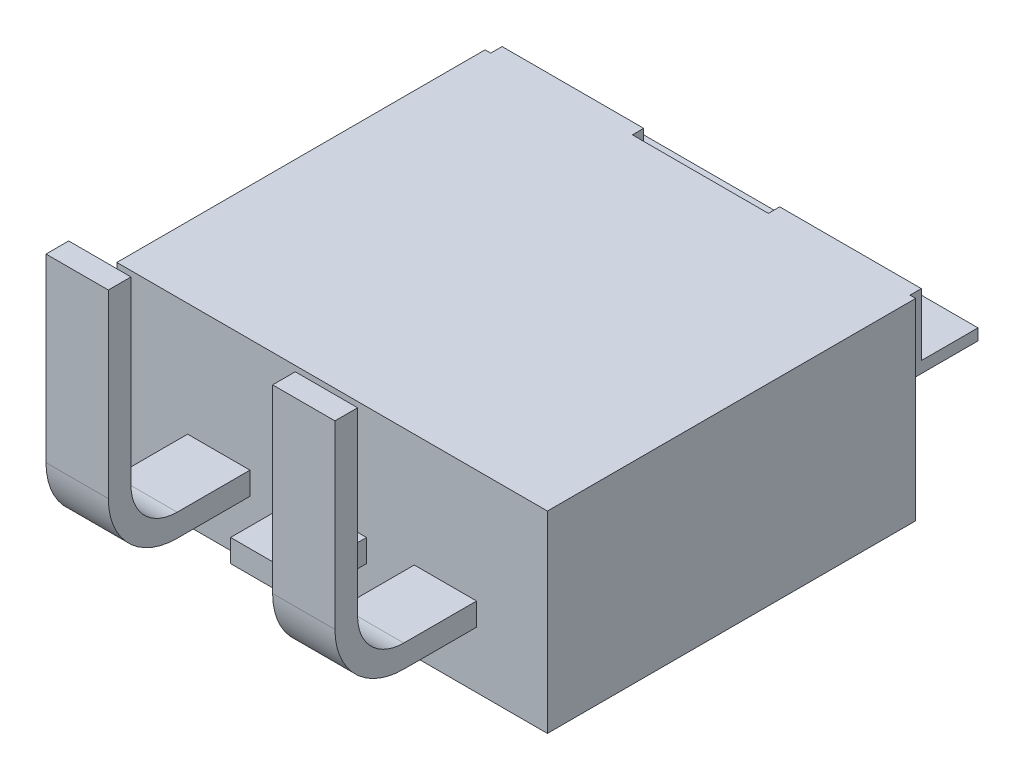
ISO-10303-21;
HEADER;
FILE_DESCRIPTION(('STEP AP214'),'2;1');
FILE_NAME('part.step','',(''),(''),'','','');
FILE_SCHEMA(('AUTOMOTIVE_DESIGN { 1 0 10303 214 1 1 1 1 }'));
ENDSEC;
DATA;
#1=APPLICATION_CONTEXT('core data for automotive mechanical design processes');
#2=APPLICATION_PROTOCOL_DEFINITION('international standard','automotive_design',2000,#1);
#3=PRODUCT_CONTEXT('',#1,'mechanical');
#4=PRODUCT('Part','Part','',(#3));
#5=PRODUCT_RELATED_PRODUCT_CATEGORY('part','',(#4));
#6=PRODUCT_DEFINITION_FORMATION('','',#4);
#7=PRODUCT_DEFINITION_CONTEXT('part definition',#1,'design');
#8=PRODUCT_DEFINITION('design','',#6,#7);
#9=PRODUCT_DEFINITION_SHAPE('','',#8);
#10=(LENGTH_UNIT() NAMED_UNIT(*) SI_UNIT(.MILLI.,.METRE.));
#11=(NAMED_UNIT(*) PLANE_ANGLE_UNIT() SI_UNIT($,.RADIAN.));
#12=(NAMED_UNIT(*) SI_UNIT($,.STERADIAN.) SOLID_ANGLE_UNIT());
#13=UNCERTAINTY_MEASURE_WITH_UNIT(LENGTH_MEASURE(1.E-05),#10,'distance_accuracy_value','');
#14=(GEOMETRIC_REPRESENTATION_CONTEXT(3) GLOBAL_UNCERTAINTY_ASSIGNED_CONTEXT((#13)) GLOBAL_UNIT_ASSIGNED_CONTEXT((#10,
#11,#12)) REPRESENTATION_CONTEXT('',''));
#15=CARTESIAN_POINT('',(0.,0.,0.));
#16=DIRECTION('',(0.,0.,1.));
#17=DIRECTION('',(1.,0.,0.));
#18=AXIS2_PLACEMENT_3D('',#15,#16,#17);
#19=CARTESIAN_POINT('',(48.98644,2.54451166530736,-34.586437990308));
#20=DIRECTION('',(0.,1.,0.));
#21=DIRECTION('',(0.,0.,-1.));
#22=AXIS2_PLACEMENT_3D('',#19,#20,#21);
#23=PLANE('',#22);
#24=DIRECTION('',(1.,0.,0.));
#25=VECTOR('',#24,1.);
#26=CARTESIAN_POINT('',(48.26,2.54451166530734,-35.1155));
#27=LINE('',#26,#25);
#28=CARTESIAN_POINT('',(47.5615,2.54451166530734,-35.1155));
#29=VERTEX_POINT('',#28);
#30=CARTESIAN_POINT('',(48.9585,2.54451166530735,-35.1154999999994));
#31=VERTEX_POINT('',#30);
#32=EDGE_CURVE('E267',#29,#31,#27,.T.);
#33=ORIENTED_EDGE('',*,*,#32,.F.);
#34=DIRECTION('',(0.,0.,-1.));
#35=VECTOR('',#34,1.);
#36=CARTESIAN_POINT('',(47.5615,2.54451166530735,-36.195));
#37=LINE('',#36,#35);
#38=CARTESIAN_POINT('',(47.5615,2.54451166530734,-34.6075));
#39=VERTEX_POINT('',#38);
#40=EDGE_CURVE('E258',#39,#29,#37,.T.);
#41=ORIENTED_EDGE('',*,*,#40,.F.);
#42=DIRECTION('',(-1.,0.,0.));
#43=VECTOR('',#42,1.);
#44=CARTESIAN_POINT('',(48.26,2.54451166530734,-34.6075));
#45=LINE('',#44,#43);
#46=CARTESIAN_POINT('',(48.9585,2.54451166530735,-34.6075000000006));
#47=VERTEX_POINT('',#46);
#48=EDGE_CURVE('E314',#47,#39,#45,.T.);
#49=ORIENTED_EDGE('',*,*,#48,.F.);
#50=DIRECTION('',(0.,0.,-1.));
#51=VECTOR('',#50,1.);
#52=CARTESIAN_POINT('',(48.9585,2.54451166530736,-34.8615));
#53=LINE('',#52,#51);
#54=EDGE_CURVE('E328',#47,#31,#53,.T.);
#55=ORIENTED_EDGE('',*,*,#54,.T.);
#56=EDGE_LOOP('',(#33,#41,#49,#55));
#57=FACE_BOUND('',#56,.T.);
#58=ADVANCED_FACE('F16',(#57),#23,.T.);
#59=CARTESIAN_POINT('',(47.5615,2.65636189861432,-37.846));
#60=DIRECTION('',(-1.,0.,0.));
#61=DIRECTION('',(0.,-1.,0.));
#62=AXIS2_PLACEMENT_3D('',#59,#60,#61);
#63=PLANE('',#62);
#64=CARTESIAN_POINT('',(47.5615,-1.50536916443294,-36.1501308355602));
#65=DIRECTION('',(-1.,0.,0.));
#66=DIRECTION('',(0.,0.,1.));
#67=AXIS2_PLACEMENT_3D('',#64,#65,#66);
#68=CIRCLE('',#67,1.0346308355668);
#69=CARTESIAN_POINT('',(47.5615,-1.505369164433,-35.1154999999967));
#70=VERTEX_POINT('',#69);
#71=CARTESIAN_POINT('',(47.5615,-2.54000000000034,-36.1501308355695));
#72=VERTEX_POINT('',#71);
#73=EDGE_CURVE('E20',#70,#72,#68,.F.);
#74=ORIENTED_EDGE('',*,*,#73,.T.);
#75=DIRECTION('',(0.,0.,-1.));
#76=VECTOR('',#75,1.);
#77=CARTESIAN_POINT('',(47.5615,-2.54000000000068,-36.195));
#78=LINE('',#77,#76);
#79=CARTESIAN_POINT('',(47.5615,-2.54000000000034,-37.7825));
#80=VERTEX_POINT('',#79);
#81=EDGE_CURVE('E257',#72,#80,#78,.T.);
#82=ORIENTED_EDGE('',*,*,#81,.T.);
#83=DIRECTION('',(0.,-1.,0.));
#84=VECTOR('',#83,1.);
#85=CARTESIAN_POINT('',(47.5615,-0.25174416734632,-37.7825));
#86=LINE('',#85,#84);
#87=CARTESIAN_POINT('',(47.5615,-3.0480000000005,-37.7825));
#88=VERTEX_POINT('',#87);
#89=EDGE_CURVE('E322',#80,#88,#86,.T.);
#90=ORIENTED_EDGE('',*,*,#89,.T.);
#91=DIRECTION('',(0.,0.,1.));
#92=VECTOR('',#91,1.);
#93=CARTESIAN_POINT('',(47.5615,-3.04800000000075,-36.195));
#94=LINE('',#93,#92);
#95=CARTESIAN_POINT('',(47.5615,-3.04800000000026,-36.1501308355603));
#96=VERTEX_POINT('',#95);
#97=EDGE_CURVE('E320',#88,#96,#94,.T.);
#98=ORIENTED_EDGE('',*,*,#97,.T.);
#99=CARTESIAN_POINT('',(47.5615,-1.50536916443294,-36.1501308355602));
#100=DIRECTION('',(-1.,0.,0.));
#101=DIRECTION('',(0.,0.,1.));
#102=AXIS2_PLACEMENT_3D('',#99,#100,#101);
#103=CIRCLE('',#102,1.54263083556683);
#104=CARTESIAN_POINT('',(47.5615,-1.50536916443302,-34.6074999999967));
#105=VERTEX_POINT('',#104);
#106=EDGE_CURVE('E356',#96,#105,#103,.T.);
#107=ORIENTED_EDGE('',*,*,#106,.T.);
#108=DIRECTION('',(0.,-1.,0.));
#109=VECTOR('',#108,1.);
#110=CARTESIAN_POINT('',(47.5615,0.519571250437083,-34.6075));
#111=LINE('',#110,#109);
#112=EDGE_CURVE('E311',#39,#105,#111,.T.);
#113=ORIENTED_EDGE('',*,*,#112,.F.);
#114=ORIENTED_EDGE('',*,*,#40,.T.);
#115=DIRECTION('',(0.,1.,0.));
#116=VECTOR('',#115,1.);
#117=CARTESIAN_POINT('',(47.5615,0.519571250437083,-35.1155));
#118=LINE('',#117,#116);
#119=EDGE_CURVE('E260',#70,#29,#118,.T.);
#120=ORIENTED_EDGE('',*,*,#119,.F.);
#121=EDGE_LOOP('',(#74,#82,#90,#98,#107,#113,#114,#120));
#122=FACE_BOUND('',#121,.T.);
#123=ADVANCED_FACE('F261',(#122),#63,.T.);
#124=CARTESIAN_POINT('',(54.06644,2.54451166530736,-34.586437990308));
#125=DIRECTION('',(0.,1.,0.));
#126=DIRECTION('',(0.,0.,-1.));
#127=AXIS2_PLACEMENT_3D('',#124,#125,#126);
#128=PLANE('',#127);
#129=DIRECTION('',(1.,0.,0.));
#130=VECTOR('',#129,1.);
#131=CARTESIAN_POINT('',(53.34,2.54451166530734,-35.1155));
#132=LINE('',#131,#130);
#133=CARTESIAN_POINT('',(52.6415,2.54451166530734,-35.1155));
#134=VERTEX_POINT('',#133);
#135=CARTESIAN_POINT('',(54.0385,2.54451166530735,-35.1154999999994));
#136=VERTEX_POINT('',#135);
#137=EDGE_CURVE('E406',#134,#136,#132,.T.);
#138=ORIENTED_EDGE('',*,*,#137,.F.);
#139=DIRECTION('',(0.,0.,-1.));
#140=VECTOR('',#139,1.);
#141=CARTESIAN_POINT('',(52.6415,2.54451166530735,-36.195));
#142=LINE('',#141,#140);
#143=CARTESIAN_POINT('',(52.6415,2.54451166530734,-34.6075));
#144=VERTEX_POINT('',#143);
#145=EDGE_CURVE('E300',#144,#134,#142,.T.);
#146=ORIENTED_EDGE('',*,*,#145,.F.);
#147=DIRECTION('',(-1.,0.,0.));
#148=VECTOR('',#147,1.);
#149=CARTESIAN_POINT('',(53.34,2.54451166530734,-34.6075));
#150=LINE('',#149,#148);
#151=CARTESIAN_POINT('',(54.0385,2.54451166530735,-34.6075000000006));
#152=VERTEX_POINT('',#151);
#153=EDGE_CURVE('E291',#152,#144,#150,.T.);
#154=ORIENTED_EDGE('',*,*,#153,.F.);
#155=DIRECTION('',(0.,0.,-1.));
#156=VECTOR('',#155,1.);
#157=CARTESIAN_POINT('',(54.0385,2.54451166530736,-34.8615));
#158=LINE('',#157,#156);
#159=EDGE_CURVE('E307',#152,#136,#158,.T.);
#160=ORIENTED_EDGE('',*,*,#159,.T.);
#161=EDGE_LOOP('',(#138,#146,#154,#160));
#162=FACE_BOUND('',#161,.T.);
#163=ADVANCED_FACE('F609',(#162),#128,.T.);
#164=CARTESIAN_POINT('',(52.6415,2.65636189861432,-37.846));
#165=DIRECTION('',(-1.,0.,0.));
#166=DIRECTION('',(0.,-1.,0.));
#167=AXIS2_PLACEMENT_3D('',#164,#165,#166);
#168=PLANE('',#167);
#169=CARTESIAN_POINT('',(52.6415,-1.50536916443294,-36.1501308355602));
#170=DIRECTION('',(-1.,0.,0.));
#171=DIRECTION('',(0.,0.,1.));
#172=AXIS2_PLACEMENT_3D('',#169,#170,#171);
#173=CIRCLE('',#172,1.0346308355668);
#174=CARTESIAN_POINT('',(52.6415000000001,-1.505369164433,-35.1154999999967));
#175=VERTEX_POINT('',#174);
#176=CARTESIAN_POINT('',(52.6415,-2.54000000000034,-36.1501308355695));
#177=VERTEX_POINT('',#176);
#178=EDGE_CURVE('E295',#175,#177,#173,.F.);
#179=ORIENTED_EDGE('',*,*,#178,.T.);
#180=DIRECTION('',(0.,0.,-1.));
#181=VECTOR('',#180,1.);
#182=CARTESIAN_POINT('',(52.6415,-2.54000000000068,-36.195));
#183=LINE('',#182,#181);
#184=CARTESIAN_POINT('',(52.6415,-2.54000000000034,-37.7825));
#185=VERTEX_POINT('',#184);
#186=EDGE_CURVE('E268',#177,#185,#183,.T.);
#187=ORIENTED_EDGE('',*,*,#186,.T.);
#188=DIRECTION('',(0.,-1.,0.));
#189=VECTOR('',#188,1.);
#190=CARTESIAN_POINT('',(52.6415,-0.25174416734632,-37.7825));
#191=LINE('',#190,#189);
#192=CARTESIAN_POINT('',(52.6415,-3.0480000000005,-37.7825));
#193=VERTEX_POINT('',#192);
#194=EDGE_CURVE('E301',#185,#193,#191,.T.);
#195=ORIENTED_EDGE('',*,*,#194,.T.);
#196=DIRECTION('',(0.,0.,1.));
#197=VECTOR('',#196,1.);
#198=CARTESIAN_POINT('',(52.6415,-3.04800000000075,-36.195));
#199=LINE('',#198,#197);
#200=CARTESIAN_POINT('',(52.6415,-3.04800000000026,-36.1501308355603));
#201=VERTEX_POINT('',#200);
#202=EDGE_CURVE('E298',#193,#201,#199,.T.);
#203=ORIENTED_EDGE('',*,*,#202,.T.);
#204=CARTESIAN_POINT('',(52.6415,-1.50536916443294,-36.1501308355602));
#205=DIRECTION('',(-1.,0.,0.));
#206=DIRECTION('',(0.,0.,1.));
#207=AXIS2_PLACEMENT_3D('',#204,#205,#206);
#208=CIRCLE('',#207,1.54263083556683);
#209=CARTESIAN_POINT('',(52.6415000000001,-1.50536916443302,-34.6074999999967));
#210=VERTEX_POINT('',#209);
#211=EDGE_CURVE('E280',#201,#210,#208,.T.);
#212=ORIENTED_EDGE('',*,*,#211,.T.);
#213=DIRECTION('',(0.,-1.,0.));
#214=VECTOR('',#213,1.);
#215=CARTESIAN_POINT('',(52.6415,0.519571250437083,-34.6075));
#216=LINE('',#215,#214);
#217=EDGE_CURVE('E288',#144,#210,#216,.T.);
#218=ORIENTED_EDGE('',*,*,#217,.F.);
#219=ORIENTED_EDGE('',*,*,#145,.T.);
#220=DIRECTION('',(0.,1.,0.));
#221=VECTOR('',#220,1.);
#222=CARTESIAN_POINT('',(52.6415,0.519571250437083,-35.1155));
#223=LINE('',#222,#221);
#224=EDGE_CURVE('E366',#175,#134,#223,.T.);
#225=ORIENTED_EDGE('',*,*,#224,.F.);
#226=EDGE_LOOP('',(#179,#187,#195,#203,#212,#218,#219,#225));
#227=FACE_BOUND('',#226,.T.);
#228=ADVANCED_FACE('F362',(#227),#168,.T.);
#229=CARTESIAN_POINT('',(48.98644,-1.58636678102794,-35.1155));
#230=DIRECTION('',(0.,0.,-1.));
#231=DIRECTION('',(-1.,0.,0.));
#232=AXIS2_PLACEMENT_3D('',#229,#230,#231);
#233=PLANE('',#232);
#234=ORIENTED_EDGE('',*,*,#32,.T.);
#235=DIRECTION('',(0.,1.,0.));
#236=VECTOR('',#235,1.);
#237=CARTESIAN_POINT('',(48.9585,-0.25174416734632,-35.1155));
#238=LINE('',#237,#236);
#239=CARTESIAN_POINT('',(48.9585,-1.505369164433,-35.1154999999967));
#240=VERTEX_POINT('',#239);
#241=EDGE_CURVE('E273',#240,#31,#238,.T.);
#242=ORIENTED_EDGE('',*,*,#241,.F.);
#243=DIRECTION('',(1.,0.,0.));
#244=VECTOR('',#243,1.);
#245=CARTESIAN_POINT('',(48.26,-1.50536916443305,-35.1154999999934));
#246=LINE('',#245,#244);
#247=EDGE_CURVE('E252',#70,#240,#246,.T.);
#248=ORIENTED_EDGE('',*,*,#247,.F.);
#249=ORIENTED_EDGE('',*,*,#119,.T.);
#250=EDGE_LOOP('',(#234,#242,#248,#249));
#251=FACE_BOUND('',#250,.T.);
#252=ADVANCED_FACE('F271',(#251),#233,.T.);
#253=CARTESIAN_POINT('',(47.53356,-1.58636678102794,-34.6075));
#254=DIRECTION('',(0.,0.,1.));
#255=DIRECTION('',(1.,0.,0.));
#256=AXIS2_PLACEMENT_3D('',#253,#254,#255);
#257=PLANE('',#256);
#258=ORIENTED_EDGE('',*,*,#48,.T.);
#259=ORIENTED_EDGE('',*,*,#112,.T.);
#260=DIRECTION('',(1.,0.,0.));
#261=VECTOR('',#260,1.);
#262=CARTESIAN_POINT('',(48.26,-1.50536916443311,-34.6074999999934));
#263=LINE('',#262,#261);
#264=CARTESIAN_POINT('',(48.9585,-1.50536916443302,-34.6074999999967));
#265=VERTEX_POINT('',#264);
#266=EDGE_CURVE('E358',#105,#265,#263,.T.);
#267=ORIENTED_EDGE('',*,*,#266,.T.);
#268=DIRECTION('',(0.,-1.,0.));
#269=VECTOR('',#268,1.);
#270=CARTESIAN_POINT('',(48.9585,-0.25174416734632,-34.6075));
#271=LINE('',#270,#269);
#272=EDGE_CURVE('E352',#47,#265,#271,.T.);
#273=ORIENTED_EDGE('',*,*,#272,.F.);
#274=EDGE_LOOP('',(#258,#259,#267,#273));
#275=FACE_BOUND('',#274,.T.);
#276=ADVANCED_FACE('F1049',(#275),#257,.T.);
#277=CARTESIAN_POINT('',(48.9585,-1.50536916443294,-36.1501308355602));
#278=DIRECTION('',(-1.,0.,0.));
#279=DIRECTION('',(0.,0.,1.));
#280=AXIS2_PLACEMENT_3D('',#277,#278,#279);
#281=CYLINDRICAL_SURFACE('',#280,1.54263083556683);
#282=ORIENTED_EDGE('',*,*,#266,.F.);
#283=ORIENTED_EDGE('',*,*,#106,.F.);
#284=DIRECTION('',(-1.,0.,0.));
#285=VECTOR('',#284,1.);
#286=CARTESIAN_POINT('',(48.26,-3.04799999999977,-36.1501308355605));
#287=LINE('',#286,#285);
#288=CARTESIAN_POINT('',(48.9585,-3.04799999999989,-36.1501308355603));
#289=VERTEX_POINT('',#288);
#290=EDGE_CURVE('E313',#289,#96,#287,.T.);
#291=ORIENTED_EDGE('',*,*,#290,.F.);
#292=CARTESIAN_POINT('',(48.9585,-1.50536916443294,-36.1501308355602));
#293=DIRECTION('',(-1.,0.,0.));
#294=DIRECTION('',(0.,0.,1.));
#295=AXIS2_PLACEMENT_3D('',#292,#293,#294);
#296=CIRCLE('',#295,1.54263083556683);
#297=EDGE_CURVE('E348',#265,#289,#296,.F.);
#298=ORIENTED_EDGE('',*,*,#297,.F.);
#299=EDGE_LOOP('',(#282,#283,#291,#298));
#300=FACE_BOUND('',#299,.T.);
#301=ADVANCED_FACE('F1040',(#300),#281,.T.);
#302=CARTESIAN_POINT('',(54.06644,-1.58636678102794,-35.1155));
#303=DIRECTION('',(0.,0.,-1.));
#304=DIRECTION('',(-1.,0.,0.));
#305=AXIS2_PLACEMENT_3D('',#302,#303,#304);
#306=PLANE('',#305);
#307=ORIENTED_EDGE('',*,*,#137,.T.);
#308=DIRECTION('',(0.,1.,0.));
#309=VECTOR('',#308,1.);
#310=CARTESIAN_POINT('',(54.0385,-0.25174416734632,-35.1155));
#311=LINE('',#310,#309);
#312=CARTESIAN_POINT('',(54.0385,-1.505369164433,-35.1154999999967));
#313=VERTEX_POINT('',#312);
#314=EDGE_CURVE('E346',#313,#136,#311,.T.);
#315=ORIENTED_EDGE('',*,*,#314,.F.);
#316=DIRECTION('',(1.,0.,0.));
#317=VECTOR('',#316,1.);
#318=CARTESIAN_POINT('',(53.34,-1.50536916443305,-35.1154999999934));
#319=LINE('',#318,#317);
#320=EDGE_CURVE('E351',#175,#313,#319,.T.);
#321=ORIENTED_EDGE('',*,*,#320,.F.);
#322=ORIENTED_EDGE('',*,*,#224,.T.);
#323=EDGE_LOOP('',(#307,#315,#321,#322));
#324=FACE_BOUND('',#323,.T.);
#325=ADVANCED_FACE('F607',(#324),#306,.T.);
#326=CARTESIAN_POINT('',(52.61356,-1.58636678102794,-34.6075));
#327=DIRECTION('',(0.,0.,1.));
#328=DIRECTION('',(1.,0.,0.));
#329=AXIS2_PLACEMENT_3D('',#326,#327,#328);
#330=PLANE('',#329);
#331=ORIENTED_EDGE('',*,*,#153,.T.);
#332=ORIENTED_EDGE('',*,*,#217,.T.);
#333=DIRECTION('',(1.,0.,0.));
#334=VECTOR('',#333,1.);
#335=CARTESIAN_POINT('',(53.34,-1.50536916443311,-34.6074999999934));
#336=LINE('',#335,#334);
#337=CARTESIAN_POINT('',(54.0385,-1.50536916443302,-34.6074999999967));
#338=VERTEX_POINT('',#337);
#339=EDGE_CURVE('E275',#210,#338,#336,.T.);
#340=ORIENTED_EDGE('',*,*,#339,.T.);
#341=DIRECTION('',(0.,-1.,0.));
#342=VECTOR('',#341,1.);
#343=CARTESIAN_POINT('',(54.0385,-0.25174416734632,-34.6075));
#344=LINE('',#343,#342);
#345=EDGE_CURVE('E342',#152,#338,#344,.T.);
#346=ORIENTED_EDGE('',*,*,#345,.F.);
#347=EDGE_LOOP('',(#331,#332,#340,#346));
#348=FACE_BOUND('',#347,.T.);
#349=ADVANCED_FACE('F602',(#348),#330,.T.);
#350=CARTESIAN_POINT('',(54.0385,-1.50536916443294,-36.1501308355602));
#351=DIRECTION('',(-1.,0.,0.));
#352=DIRECTION('',(0.,0.,1.));
#353=AXIS2_PLACEMENT_3D('',#350,#351,#352);
#354=CYLINDRICAL_SURFACE('',#353,1.54263083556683);
#355=ORIENTED_EDGE('',*,*,#339,.F.);
#356=ORIENTED_EDGE('',*,*,#211,.F.);
#357=DIRECTION('',(-1.,0.,0.));
#358=VECTOR('',#357,1.);
#359=CARTESIAN_POINT('',(53.34,-3.04799999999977,-36.1501308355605));
#360=LINE('',#359,#358);
#361=CARTESIAN_POINT('',(54.0385,-3.04799999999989,-36.1501308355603));
#362=VERTEX_POINT('',#361);
#363=EDGE_CURVE('E290',#362,#201,#360,.T.);
#364=ORIENTED_EDGE('',*,*,#363,.F.);
#365=CARTESIAN_POINT('',(54.0385,-1.50536916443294,-36.1501308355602));
#366=DIRECTION('',(-1.,0.,0.));
#367=DIRECTION('',(0.,0.,1.));
#368=AXIS2_PLACEMENT_3D('',#365,#366,#367);
#369=CIRCLE('',#368,1.54263083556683);
#370=EDGE_CURVE('E338',#338,#362,#369,.F.);
#371=ORIENTED_EDGE('',*,*,#370,.F.);
#372=EDGE_LOOP('',(#355,#356,#364,#371));
#373=FACE_BOUND('',#372,.T.);
#374=ADVANCED_FACE('F397',(#373),#354,.T.);
#375=CARTESIAN_POINT('',(48.9585,-1.50536916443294,-36.1501308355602));
#376=DIRECTION('',(-1.,0.,0.));
#377=DIRECTION('',(0.,0.,1.));
#378=AXIS2_PLACEMENT_3D('',#375,#376,#377);
#379=CYLINDRICAL_SURFACE('',#378,1.0346308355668);
#380=ORIENTED_EDGE('',*,*,#247,.T.);
#381=CARTESIAN_POINT('',(48.9585,-1.50536916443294,-36.1501308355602));
#382=DIRECTION('',(-1.,0.,0.));
#383=DIRECTION('',(0.,0.,1.));
#384=AXIS2_PLACEMENT_3D('',#381,#382,#383);
#385=CIRCLE('',#384,1.0346308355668);
#386=CARTESIAN_POINT('',(48.9585,-2.54,-36.1501308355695));
#387=VERTEX_POINT('',#386);
#388=EDGE_CURVE('E277',#387,#240,#385,.T.);
#389=ORIENTED_EDGE('',*,*,#388,.F.);
#390=DIRECTION('',(1.,0.,0.));
#391=VECTOR('',#390,1.);
#392=CARTESIAN_POINT('',(48.26,-2.54,-36.1501308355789));
#393=LINE('',#392,#391);
#394=EDGE_CURVE('E254',#72,#387,#393,.T.);
#395=ORIENTED_EDGE('',*,*,#394,.F.);
#396=ORIENTED_EDGE('',*,*,#73,.F.);
#397=EDGE_LOOP('',(#380,#389,#395,#396));
#398=FACE_BOUND('',#397,.T.);
#399=ADVANCED_FACE('F249',(#398),#379,.F.);
#400=CARTESIAN_POINT('',(48.9585,-3.15985023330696,-37.846));
#401=DIRECTION('',(1.,0.,0.));
#402=DIRECTION('',(0.,1.,0.));
#403=AXIS2_PLACEMENT_3D('',#400,#401,#402);
#404=PLANE('',#403);
#405=ORIENTED_EDGE('',*,*,#297,.T.);
#406=DIRECTION('',(0.,0.,1.));
#407=VECTOR('',#406,1.);
#408=CARTESIAN_POINT('',(48.9585,-3.048,-36.9663154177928));
#409=LINE('',#408,#407);
#410=CARTESIAN_POINT('',(48.9585,-3.04800000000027,-37.7825000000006));
#411=VERTEX_POINT('',#410);
#412=EDGE_CURVE('E437',#411,#289,#409,.T.);
#413=ORIENTED_EDGE('',*,*,#412,.F.);
#414=DIRECTION('',(0.,1.,0.));
#415=VECTOR('',#414,1.);
#416=CARTESIAN_POINT('',(48.9585,-0.25174416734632,-37.7825));
#417=LINE('',#416,#415);
#418=CARTESIAN_POINT('',(48.9585,-2.54,-37.7825000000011));
#419=VERTEX_POINT('',#418);
#420=EDGE_CURVE('E274',#411,#419,#417,.T.);
#421=ORIENTED_EDGE('',*,*,#420,.T.);
#422=DIRECTION('',(0.,0.,-1.));
#423=VECTOR('',#422,1.);
#424=CARTESIAN_POINT('',(48.9585,-2.54,-36.9663154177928));
#425=LINE('',#424,#423);
#426=EDGE_CURVE('E436',#387,#419,#425,.T.);
#427=ORIENTED_EDGE('',*,*,#426,.F.);
#428=ORIENTED_EDGE('',*,*,#388,.T.);
#429=ORIENTED_EDGE('',*,*,#241,.T.);
#430=ORIENTED_EDGE('',*,*,#54,.F.);
#431=ORIENTED_EDGE('',*,*,#272,.T.);
#432=EDGE_LOOP('',(#405,#413,#421,#427,#428,#429,#430,#431));
#433=FACE_BOUND('',#432,.T.);
#434=ADVANCED_FACE('F425',(#433),#404,.T.);
#435=CARTESIAN_POINT('',(54.0385,-1.50536916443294,-36.1501308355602));
#436=DIRECTION('',(-1.,0.,0.));
#437=DIRECTION('',(0.,0.,1.));
#438=AXIS2_PLACEMENT_3D('',#435,#436,#437);
#439=CYLINDRICAL_SURFACE('',#438,1.0346308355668);
#440=ORIENTED_EDGE('',*,*,#320,.T.);
#441=CARTESIAN_POINT('',(54.0385,-1.50536916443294,-36.1501308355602));
#442=DIRECTION('',(-1.,0.,0.));
#443=DIRECTION('',(0.,0.,1.));
#444=AXIS2_PLACEMENT_3D('',#441,#442,#443);
#445=CIRCLE('',#444,1.0346308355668);
#446=CARTESIAN_POINT('',(54.0385,-2.54,-36.1501308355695));
#447=VERTEX_POINT('',#446);
#448=EDGE_CURVE('E343',#447,#313,#445,.T.);
#449=ORIENTED_EDGE('',*,*,#448,.F.);
#450=DIRECTION('',(1.,0.,0.));
#451=VECTOR('',#450,1.);
#452=CARTESIAN_POINT('',(53.34,-2.54,-36.1501308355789));
#453=LINE('',#452,#451);
#454=EDGE_CURVE('E370',#177,#447,#453,.T.);
#455=ORIENTED_EDGE('',*,*,#454,.F.);
#456=ORIENTED_EDGE('',*,*,#178,.F.);
#457=EDGE_LOOP('',(#440,#449,#455,#456));
#458=FACE_BOUND('',#457,.T.);
#459=ADVANCED_FACE('F371',(#458),#439,.F.);
#460=CARTESIAN_POINT('',(54.0385,-3.15985023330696,-37.846));
#461=DIRECTION('',(1.,0.,0.));
#462=DIRECTION('',(0.,1.,0.));
#463=AXIS2_PLACEMENT_3D('',#460,#461,#462);
#464=PLANE('',#463);
#465=ORIENTED_EDGE('',*,*,#370,.T.);
#466=DIRECTION('',(0.,0.,1.));
#467=VECTOR('',#466,1.);
#468=CARTESIAN_POINT('',(54.0385,-3.048,-36.9663154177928));
#469=LINE('',#468,#467);
#470=CARTESIAN_POINT('',(54.0385,-3.04800000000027,-37.7825000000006));
#471=VERTEX_POINT('',#470);
#472=EDGE_CURVE('E376',#471,#362,#469,.T.);
#473=ORIENTED_EDGE('',*,*,#472,.F.);
#474=DIRECTION('',(0.,1.,0.));
#475=VECTOR('',#474,1.);
#476=CARTESIAN_POINT('',(54.0385,-0.25174416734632,-37.7825));
#477=LINE('',#476,#475);
#478=CARTESIAN_POINT('',(54.0385,-2.54,-37.7825000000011));
#479=VERTEX_POINT('',#478);
#480=EDGE_CURVE('E347',#471,#479,#477,.T.);
#481=ORIENTED_EDGE('',*,*,#480,.T.);
#482=DIRECTION('',(0.,0.,-1.));
#483=VECTOR('',#482,1.);
#484=CARTESIAN_POINT('',(54.0385,-2.54,-36.9663154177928));
#485=LINE('',#484,#483);
#486=EDGE_CURVE('E375',#447,#479,#485,.T.);
#487=ORIENTED_EDGE('',*,*,#486,.F.);
#488=ORIENTED_EDGE('',*,*,#448,.T.);
#489=ORIENTED_EDGE('',*,*,#314,.T.);
#490=ORIENTED_EDGE('',*,*,#159,.F.);
#491=ORIENTED_EDGE('',*,*,#345,.T.);
#492=EDGE_LOOP('',(#465,#473,#481,#487,#488,#489,#490,#491));
#493=FACE_BOUND('',#492,.T.);
#494=ADVANCED_FACE('F598',(#493),#464,.T.);
#495=CARTESIAN_POINT('',(51.5713806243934,-3.06906200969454,-37.81298));
#496=DIRECTION('',(1.,0.,0.));
#497=DIRECTION('',(0.,1.,0.));
#498=AXIS2_PLACEMENT_3D('',#495,#496,#497);
#499=PLANE('',#498);
#500=DIRECTION('',(0.,1.,0.));
#501=VECTOR('',#500,1.);
#502=CARTESIAN_POINT('',(51.5713806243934,-2.79400000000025,-36.2585));
#503=LINE('',#502,#501);
#504=CARTESIAN_POINT('',(51.5713806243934,-3.04800000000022,-36.2585));
#505=VERTEX_POINT('',#504);
#506=CARTESIAN_POINT('',(51.5713806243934,-2.54,-36.2585));
#507=VERTEX_POINT('',#506);
#508=EDGE_CURVE('E574',#505,#507,#503,.T.);
#509=ORIENTED_EDGE('',*,*,#508,.F.);
#510=DIRECTION('',(0.,0.,1.));
#511=VECTOR('',#510,1.);
#512=CARTESIAN_POINT('',(51.5713806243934,-3.048,-37.0205));
#513=LINE('',#512,#511);
#514=CARTESIAN_POINT('',(51.5713806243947,-3.04800000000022,-37.7825));
#515=VERTEX_POINT('',#514);
#516=EDGE_CURVE('E538',#515,#505,#513,.T.);
#517=ORIENTED_EDGE('',*,*,#516,.F.);
#518=DIRECTION('',(0.,1.,0.));
#519=VECTOR('',#518,1.);
#520=CARTESIAN_POINT('',(51.5713806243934,-2.79400000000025,-37.7825));
#521=LINE('',#520,#519);
#522=CARTESIAN_POINT('',(51.5713806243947,-2.54000000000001,-37.7825));
#523=VERTEX_POINT('',#522);
#524=EDGE_CURVE('E341',#515,#523,#521,.T.);
#525=ORIENTED_EDGE('',*,*,#524,.T.);
#526=DIRECTION('',(0.,0.,-1.));
#527=VECTOR('',#526,1.);
#528=CARTESIAN_POINT('',(51.5713806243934,-2.54,-37.0205));
#529=LINE('',#528,#527);
#530=EDGE_CURVE('E540',#507,#523,#529,.T.);
#531=ORIENTED_EDGE('',*,*,#530,.F.);
#532=EDGE_LOOP('',(#509,#517,#525,#531));
#533=FACE_BOUND('',#532,.T.);
#534=ADVANCED_FACE('F680',(#533),#499,.T.);
#535=CARTESIAN_POINT('',(51.6018606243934,-2.51893799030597,-36.2585));
#536=DIRECTION('',(0.,0.,1.));
#537=DIRECTION('',(-1.,0.,0.));
#538=AXIS2_PLACEMENT_3D('',#535,#536,#537);
#539=PLANE('',#538);
#540=DIRECTION('',(-1.,0.,0.));
#541=VECTOR('',#540,1.);
#542=CARTESIAN_POINT('',(50.8093806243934,-3.048,-36.2585));
#543=LINE('',#542,#541);
#544=CARTESIAN_POINT('',(50.0473806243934,-3.04800000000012,-36.2585));
#545=VERTEX_POINT('',#544);
#546=EDGE_CURVE('E536',#505,#545,#543,.T.);
#547=ORIENTED_EDGE('',*,*,#546,.F.);
#548=ORIENTED_EDGE('',*,*,#508,.T.);
#549=DIRECTION('',(1.,0.,0.));
#550=VECTOR('',#549,1.);
#551=CARTESIAN_POINT('',(50.8093806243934,-2.54,-36.2585));
#552=LINE('',#551,#550);
#553=CARTESIAN_POINT('',(50.0473806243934,-2.54000000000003,-36.2585));
#554=VERTEX_POINT('',#553);
#555=EDGE_CURVE('E543',#554,#507,#552,.T.);
#556=ORIENTED_EDGE('',*,*,#555,.F.);
#557=DIRECTION('',(0.,1.,0.));
#558=VECTOR('',#557,1.);
#559=CARTESIAN_POINT('',(50.0473806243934,-2.79400000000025,-36.2585));
#560=LINE('',#559,#558);
#561=EDGE_CURVE('E570',#545,#554,#560,.T.);
#562=ORIENTED_EDGE('',*,*,#561,.F.);
#563=EDGE_LOOP('',(#547,#548,#556,#562));
#564=FACE_BOUND('',#563,.T.);
#565=ADVANCED_FACE('F689',(#564),#539,.T.);
#566=CARTESIAN_POINT('',(50.0473806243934,-2.51893799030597,-37.81298));
#567=DIRECTION('',(-1.,0.,0.));
#568=DIRECTION('',(0.,-1.,0.));
#569=AXIS2_PLACEMENT_3D('',#566,#567,#568);
#570=PLANE('',#569);
#571=ORIENTED_EDGE('',*,*,#561,.T.);
#572=DIRECTION('',(0.,0.,1.));
#573=VECTOR('',#572,1.);
#574=CARTESIAN_POINT('',(50.0473806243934,-2.54,-37.0205));
#575=LINE('',#574,#573);
#576=CARTESIAN_POINT('',(50.0473806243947,-2.54000000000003,-37.7825));
#577=VERTEX_POINT('',#576);
#578=EDGE_CURVE('E546',#577,#554,#575,.T.);
#579=ORIENTED_EDGE('',*,*,#578,.F.);
#580=DIRECTION('',(0.,-1.,0.));
#581=VECTOR('',#580,1.);
#582=CARTESIAN_POINT('',(50.0473806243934,-2.79400000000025,-37.7825));
#583=LINE('',#582,#581);
#584=CARTESIAN_POINT('',(50.0473806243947,-3.04800000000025,-37.7825));
#585=VERTEX_POINT('',#584);
#586=EDGE_CURVE('E572',#577,#585,#583,.T.);
#587=ORIENTED_EDGE('',*,*,#586,.T.);
#588=DIRECTION('',(0.,0.,-1.));
#589=VECTOR('',#588,1.);
#590=CARTESIAN_POINT('',(50.0473806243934,-3.048,-37.0205));
#591=LINE('',#590,#589);
#592=EDGE_CURVE('E533',#545,#585,#591,.T.);
#593=ORIENTED_EDGE('',*,*,#592,.F.);
#594=EDGE_LOOP('',(#571,#579,#587,#593));
#595=FACE_BOUND('',#594,.T.);
#596=ADVANCED_FACE('F687',(#595),#570,.T.);
#597=CARTESIAN_POINT('',(49.21504,-1.37593799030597,-46.5455));
#598=DIRECTION('',(0.,0.,-1.));
#599=DIRECTION('',(1.,0.,0.));
#600=AXIS2_PLACEMENT_3D('',#597,#598,#599);
#601=PLANE('',#600);
#602=DIRECTION('',(1.,0.,0.));
#603=VECTOR('',#602,1.);
#604=CARTESIAN_POINT('',(50.8,-1.397,-46.5455));
#605=LINE('',#604,#603);
#606=CARTESIAN_POINT('',(49.276,-1.397,-46.5454999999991));
#607=VERTEX_POINT('',#606);
#608=CARTESIAN_POINT('',(52.324,-1.397,-46.5454999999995));
#609=VERTEX_POINT('',#608);
#610=EDGE_CURVE('E520',#607,#609,#605,.T.);
#611=ORIENTED_EDGE('',*,*,#610,.F.);
#612=DIRECTION('',(0.,-1.,0.));
#613=VECTOR('',#612,1.);
#614=CARTESIAN_POINT('',(49.276,-0.8255,-46.5454999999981));
#615=LINE('',#614,#613);
#616=CARTESIAN_POINT('',(49.276,-1.65099999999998,-46.5454999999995));
#617=VERTEX_POINT('',#616);
#618=EDGE_CURVE('E528',#607,#617,#615,.T.);
#619=ORIENTED_EDGE('',*,*,#618,.T.);
#620=DIRECTION('',(-1.,0.,0.));
#621=VECTOR('',#620,1.);
#622=CARTESIAN_POINT('',(50.8,-1.651,-46.5455));
#623=LINE('',#622,#621);
#624=CARTESIAN_POINT('',(52.324,-1.65099999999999,-46.5454999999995));
#625=VERTEX_POINT('',#624);
#626=EDGE_CURVE('E564',#625,#617,#623,.T.);
#627=ORIENTED_EDGE('',*,*,#626,.F.);
#628=DIRECTION('',(0.,1.,0.));
#629=VECTOR('',#628,1.);
#630=CARTESIAN_POINT('',(52.324,-0.8255,-46.5454999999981));
#631=LINE('',#630,#629);
#632=EDGE_CURVE('E556',#625,#609,#631,.T.);
#633=ORIENTED_EDGE('',*,*,#632,.T.);
#634=EDGE_LOOP('',(#611,#619,#627,#633));
#635=FACE_BOUND('',#634,.T.);
#636=ADVANCED_FACE('F696',(#635),#601,.F.);
#637=CARTESIAN_POINT('',(55.68696,-1.37593799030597,-47.5615));
#638=DIRECTION('',(0.,0.,-1.));
#639=DIRECTION('',(0.,-1.,0.));
#640=AXIS2_PLACEMENT_3D('',#637,#638,#639);
#641=PLANE('',#640);
#642=DIRECTION('',(0.,1.,0.));
#643=VECTOR('',#642,1.);
#644=CARTESIAN_POINT('',(46.101,-1.524,-47.5615));
#645=LINE('',#644,#643);
#646=CARTESIAN_POINT('',(46.101,-1.651,-47.5615));
#647=VERTEX_POINT('',#646);
#648=CARTESIAN_POINT('',(46.101,-1.39700000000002,-47.5615));
#649=VERTEX_POINT('',#648);
#650=EDGE_CURVE('E568',#647,#649,#645,.T.);
#651=ORIENTED_EDGE('',*,*,#650,.T.);
#652=DIRECTION('',(-1.,0.,0.));
#653=VECTOR('',#652,1.);
#654=CARTESIAN_POINT('',(50.8,-1.397,-47.5615));
#655=LINE('',#654,#653);
#656=CARTESIAN_POINT('',(55.499,-1.39700000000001,-47.5615));
#657=VERTEX_POINT('',#656);
#658=EDGE_CURVE('E512',#657,#649,#655,.T.);
#659=ORIENTED_EDGE('',*,*,#658,.F.);
#660=DIRECTION('',(0.,-1.,0.));
#661=VECTOR('',#660,1.);
#662=CARTESIAN_POINT('',(55.499,-0.8255,-47.5615));
#663=LINE('',#662,#661);
#664=CARTESIAN_POINT('',(55.499,-1.651,-47.5615));
#665=VERTEX_POINT('',#664);
#666=EDGE_CURVE('E551',#657,#665,#663,.T.);
#667=ORIENTED_EDGE('',*,*,#666,.T.);
#668=DIRECTION('',(1.,0.,0.));
#669=VECTOR('',#668,1.);
#670=CARTESIAN_POINT('',(50.8,-1.651,-47.5615));
#671=LINE('',#670,#669);
#672=EDGE_CURVE('E566',#647,#665,#671,.T.);
#673=ORIENTED_EDGE('',*,*,#672,.F.);
#674=EDGE_LOOP('',(#651,#659,#667,#673));
#675=FACE_BOUND('',#674,.T.);
#676=ADVANCED_FACE('F703',(#675),#641,.T.);
#677=CARTESIAN_POINT('',(55.68696,-1.651,-47.59198));
#678=DIRECTION('',(0.,-1.,0.));
#679=DIRECTION('',(0.,0.,1.));
#680=AXIS2_PLACEMENT_3D('',#677,#678,#679);
#681=PLANE('',#680);
#682=DIRECTION('',(0.,0.,-1.));
#683=VECTOR('',#682,1.);
#684=CARTESIAN_POINT('',(52.324,-1.651,-46.2915));
#685=LINE('',#684,#683);
#686=CARTESIAN_POINT('',(52.324,-1.651,-46.0375000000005));
#687=VERTEX_POINT('',#686);
#688=EDGE_CURVE('E559',#687,#625,#685,.T.);
#689=ORIENTED_EDGE('',*,*,#688,.T.);
#690=ORIENTED_EDGE('',*,*,#626,.T.);
#691=DIRECTION('',(0.,0.,1.));
#692=VECTOR('',#691,1.);
#693=CARTESIAN_POINT('',(49.276,-1.651,-46.2915));
#694=LINE('',#693,#692);
#695=CARTESIAN_POINT('',(49.276,-1.651,-46.0375000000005));
#696=VERTEX_POINT('',#695);
#697=EDGE_CURVE('E525',#617,#696,#694,.T.);
#698=ORIENTED_EDGE('',*,*,#697,.T.);
#699=DIRECTION('',(1.,0.,0.));
#700=VECTOR('',#699,1.);
#701=CARTESIAN_POINT('',(50.8,-1.651,-46.0375));
#702=LINE('',#701,#700);
#703=CARTESIAN_POINT('',(46.101,-1.651,-46.0375));
#704=VERTEX_POINT('',#703);
#705=EDGE_CURVE('E490',#704,#696,#702,.T.);
#706=ORIENTED_EDGE('',*,*,#705,.F.);
#707=DIRECTION('',(0.,0.,1.));
#708=VECTOR('',#707,1.);
#709=CARTESIAN_POINT('',(46.101,-1.651,-46.7995));
#710=LINE('',#709,#708);
#711=EDGE_CURVE('E506',#647,#704,#710,.T.);
#712=ORIENTED_EDGE('',*,*,#711,.F.);
#713=ORIENTED_EDGE('',*,*,#672,.T.);
#714=DIRECTION('',(0.,0.,1.));
#715=VECTOR('',#714,1.);
#716=CARTESIAN_POINT('',(55.499,-1.651,-46.7995));
#717=LINE('',#716,#715);
#718=CARTESIAN_POINT('',(55.499,-1.651,-46.0375));
#719=VERTEX_POINT('',#718);
#720=EDGE_CURVE('E452',#665,#719,#717,.T.);
#721=ORIENTED_EDGE('',*,*,#720,.T.);
#722=DIRECTION('',(1.,0.,0.));
#723=VECTOR('',#722,1.);
#724=CARTESIAN_POINT('',(50.8,-1.651,-46.0375));
#725=LINE('',#724,#723);
#726=EDGE_CURVE('E504',#687,#719,#725,.T.);
#727=ORIENTED_EDGE('',*,*,#726,.F.);
#728=EDGE_LOOP('',(#689,#690,#698,#706,#712,#713,#721,#727));
#729=FACE_BOUND('',#728,.T.);
#730=ADVANCED_FACE('F637',(#729),#681,.T.);
#731=CARTESIAN_POINT('',(52.324,0.03302,-46.566562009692));
#732=DIRECTION('',(1.,0.,0.));
#733=DIRECTION('',(0.,0.,1.));
#734=AXIS2_PLACEMENT_3D('',#731,#732,#733);
#735=PLANE('',#734);
#736=DIRECTION('',(0.,0.,1.));
#737=VECTOR('',#736,1.);
#738=CARTESIAN_POINT('',(52.324,-1.397,-46.9265));
#739=LINE('',#738,#737);
#740=CARTESIAN_POINT('',(52.324,-1.397,-46.2915));
#741=VERTEX_POINT('',#740);
#742=EDGE_CURVE('E518',#609,#741,#739,.T.);
#743=ORIENTED_EDGE('',*,*,#742,.F.);
#744=ORIENTED_EDGE('',*,*,#632,.F.);
#745=ORIENTED_EDGE('',*,*,#688,.F.);
#746=DIRECTION('',(0.,-1.,0.));
#747=VECTOR('',#746,1.);
#748=CARTESIAN_POINT('',(52.324,-2.159,-46.0375));
#749=LINE('',#748,#747);
#750=CARTESIAN_POINT('',(52.324,0.,-46.0375000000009));
#751=VERTEX_POINT('',#750);
#752=EDGE_CURVE('E484',#751,#687,#749,.T.);
#753=ORIENTED_EDGE('',*,*,#752,.F.);
#754=DIRECTION('',(0.,0.,1.));
#755=VECTOR('',#754,1.);
#756=CARTESIAN_POINT('',(52.324,0.,-46.2915));
#757=LINE('',#756,#755);
#758=CARTESIAN_POINT('',(52.324,0.,-46.2915));
#759=VERTEX_POINT('',#758);
#760=EDGE_CURVE('E562',#759,#751,#757,.T.);
#761=ORIENTED_EDGE('',*,*,#760,.F.);
#762=DIRECTION('',(0.,1.,0.));
#763=VECTOR('',#762,1.);
#764=CARTESIAN_POINT('',(52.324,-0.6985,-46.2915));
#765=LINE('',#764,#763);
#766=EDGE_CURVE('E481',#741,#759,#765,.T.);
#767=ORIENTED_EDGE('',*,*,#766,.F.);
#768=EDGE_LOOP('',(#743,#744,#745,#753,#761,#767));
#769=FACE_BOUND('',#768,.T.);
#770=ADVANCED_FACE('F710',(#769),#735,.F.);
#771=CARTESIAN_POINT('',(55.499,-1.68402,-46.00702));
#772=DIRECTION('',(-1.,0.,0.));
#773=DIRECTION('',(0.,1.,0.));
#774=AXIS2_PLACEMENT_3D('',#771,#772,#773);
#775=PLANE('',#774);
#776=ORIENTED_EDGE('',*,*,#666,.F.);
#777=DIRECTION('',(0.,0.,-1.));
#778=VECTOR('',#777,1.);
#779=CARTESIAN_POINT('',(55.499,-1.397,-46.9265));
#780=LINE('',#779,#778);
#781=CARTESIAN_POINT('',(55.499,-1.397,-46.2915));
#782=VERTEX_POINT('',#781);
#783=EDGE_CURVE('E515',#782,#657,#780,.T.);
#784=ORIENTED_EDGE('',*,*,#783,.F.);
#785=DIRECTION('',(0.,-1.,0.));
#786=VECTOR('',#785,1.);
#787=CARTESIAN_POINT('',(55.499,-0.6985,-46.2915));
#788=LINE('',#787,#786);
#789=CARTESIAN_POINT('',(55.499,0.,-46.2915));
#790=VERTEX_POINT('',#789);
#791=EDGE_CURVE('E479',#790,#782,#788,.T.);
#792=ORIENTED_EDGE('',*,*,#791,.F.);
#793=DIRECTION('',(0.,0.,-1.));
#794=VECTOR('',#793,1.);
#795=CARTESIAN_POINT('',(55.499,0.,-46.7995));
#796=LINE('',#795,#794);
#797=CARTESIAN_POINT('',(55.499,0.,-46.0375));
#798=VERTEX_POINT('',#797);
#799=EDGE_CURVE('E554',#798,#790,#796,.T.);
#800=ORIENTED_EDGE('',*,*,#799,.F.);
#801=DIRECTION('',(0.,1.,0.));
#802=VECTOR('',#801,1.);
#803=CARTESIAN_POINT('',(55.499,-2.159,-46.0375));
#804=LINE('',#803,#802);
#805=EDGE_CURVE('E501',#719,#798,#804,.T.);
#806=ORIENTED_EDGE('',*,*,#805,.F.);
#807=ORIENTED_EDGE('',*,*,#720,.F.);
#808=EDGE_LOOP('',(#776,#784,#792,#800,#806,#807));
#809=FACE_BOUND('',#808,.T.);
#810=ADVANCED_FACE('F713',(#809),#775,.F.);
#811=CARTESIAN_POINT('',(47.53356,-3.048,-37.8151473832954));
#812=DIRECTION('',(0.,-1.,0.));
#813=DIRECTION('',(1.,0.,0.));
#814=AXIS2_PLACEMENT_3D('',#811,#812,#813);
#815=PLANE('',#814);
#816=ORIENTED_EDGE('',*,*,#290,.T.);
#817=ORIENTED_EDGE('',*,*,#97,.F.);
#818=DIRECTION('',(-1.,0.,0.));
#819=VECTOR('',#818,1.);
#820=CARTESIAN_POINT('',(50.8,-3.048,-37.7825));
#821=LINE('',#820,#819);
#822=EDGE_CURVE('E447',#411,#88,#821,.T.);
#823=ORIENTED_EDGE('',*,*,#822,.F.);
#824=ORIENTED_EDGE('',*,*,#412,.T.);
#825=EDGE_LOOP('',(#816,#817,#823,#824));
#826=FACE_BOUND('',#825,.T.);
#827=ADVANCED_FACE('F717',(#826),#815,.T.);
#828=CARTESIAN_POINT('',(48.98644,-2.54,-37.8151473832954));
#829=DIRECTION('',(0.,1.,0.));
#830=DIRECTION('',(-1.,0.,0.));
#831=AXIS2_PLACEMENT_3D('',#828,#829,#830);
#832=PLANE('',#831);
#833=ORIENTED_EDGE('',*,*,#394,.T.);
#834=ORIENTED_EDGE('',*,*,#426,.T.);
#835=DIRECTION('',(1.,0.,0.));
#836=VECTOR('',#835,1.);
#837=CARTESIAN_POINT('',(50.8,-2.54,-37.7825));
#838=LINE('',#837,#836);
#839=EDGE_CURVE('E444',#80,#419,#838,.T.);
#840=ORIENTED_EDGE('',*,*,#839,.F.);
#841=ORIENTED_EDGE('',*,*,#81,.F.);
#842=EDGE_LOOP('',(#833,#834,#840,#841));
#843=FACE_BOUND('',#842,.T.);
#844=ADVANCED_FACE('F721',(#843),#832,.T.);
#845=CARTESIAN_POINT('',(52.61356,-3.048,-37.8151473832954));
#846=DIRECTION('',(0.,-1.,0.));
#847=DIRECTION('',(1.,0.,0.));
#848=AXIS2_PLACEMENT_3D('',#845,#846,#847);
#849=PLANE('',#848);
#850=ORIENTED_EDGE('',*,*,#363,.T.);
#851=ORIENTED_EDGE('',*,*,#202,.F.);
#852=DIRECTION('',(-1.,0.,0.));
#853=VECTOR('',#852,1.);
#854=CARTESIAN_POINT('',(50.8,-3.048,-37.7825));
#855=LINE('',#854,#853);
#856=EDGE_CURVE('E384',#471,#193,#855,.T.);
#857=ORIENTED_EDGE('',*,*,#856,.F.);
#858=ORIENTED_EDGE('',*,*,#472,.T.);
#859=EDGE_LOOP('',(#850,#851,#857,#858));
#860=FACE_BOUND('',#859,.T.);
#861=ADVANCED_FACE('F400',(#860),#849,.T.);
#862=CARTESIAN_POINT('',(54.06644,-2.54,-37.8151473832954));
#863=DIRECTION('',(0.,1.,0.));
#864=DIRECTION('',(-1.,0.,0.));
#865=AXIS2_PLACEMENT_3D('',#862,#863,#864);
#866=PLANE('',#865);
#867=ORIENTED_EDGE('',*,*,#454,.T.);
#868=ORIENTED_EDGE('',*,*,#486,.T.);
#869=DIRECTION('',(1.,0.,0.));
#870=VECTOR('',#869,1.);
#871=CARTESIAN_POINT('',(50.8,-2.54,-37.7825));
#872=LINE('',#871,#870);
#873=EDGE_CURVE('E380',#185,#479,#872,.T.);
#874=ORIENTED_EDGE('',*,*,#873,.F.);
#875=ORIENTED_EDGE('',*,*,#186,.F.);
#876=EDGE_LOOP('',(#867,#868,#874,#875));
#877=FACE_BOUND('',#876,.T.);
#878=ADVANCED_FACE('F378',(#877),#866,.T.);
#879=CARTESIAN_POINT('',(51.6018606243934,-2.54,-37.81298));
#880=DIRECTION('',(0.,1.,0.));
#881=DIRECTION('',(-1.,0.,0.));
#882=AXIS2_PLACEMENT_3D('',#879,#880,#881);
#883=PLANE('',#882);
#884=ORIENTED_EDGE('',*,*,#555,.T.);
#885=ORIENTED_EDGE('',*,*,#530,.T.);
#886=DIRECTION('',(1.,0.,0.));
#887=VECTOR('',#886,1.);
#888=CARTESIAN_POINT('',(50.8,-2.54,-37.7825));
#889=LINE('',#888,#887);
#890=EDGE_CURVE('E383',#577,#523,#889,.T.);
#891=ORIENTED_EDGE('',*,*,#890,.F.);
#892=ORIENTED_EDGE('',*,*,#578,.T.);
#893=EDGE_LOOP('',(#884,#885,#891,#892));
#894=FACE_BOUND('',#893,.T.);
#895=ADVANCED_FACE('F675',(#894),#883,.T.);
#896=CARTESIAN_POINT('',(50.0169006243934,-3.048,-37.81298));
#897=DIRECTION('',(0.,-1.,0.));
#898=DIRECTION('',(1.,0.,0.));
#899=AXIS2_PLACEMENT_3D('',#896,#897,#898);
#900=PLANE('',#899);
#901=ORIENTED_EDGE('',*,*,#546,.T.);
#902=ORIENTED_EDGE('',*,*,#592,.T.);
#903=DIRECTION('',(-1.,0.,0.));
#904=VECTOR('',#903,1.);
#905=CARTESIAN_POINT('',(50.8,-3.048,-37.7825));
#906=LINE('',#905,#904);
#907=EDGE_CURVE('E666',#515,#585,#906,.T.);
#908=ORIENTED_EDGE('',*,*,#907,.F.);
#909=ORIENTED_EDGE('',*,*,#516,.T.);
#910=EDGE_LOOP('',(#901,#902,#908,#909));
#911=FACE_BOUND('',#910,.T.);
#912=ADVANCED_FACE('F683',(#911),#900,.T.);
#913=CARTESIAN_POINT('',(55.81904,-4.318,-37.6174));
#914=DIRECTION('',(0.,-1.,0.));
#915=DIRECTION('',(-1.,0.,0.));
#916=AXIS2_PLACEMENT_3D('',#913,#914,#915);
#917=PLANE('',#916);
#918=DIRECTION('',(-1.,0.,0.));
#919=VECTOR('',#918,1.);
#920=CARTESIAN_POINT('',(50.8,-4.318,-46.0375));
#921=LINE('',#920,#919);
#922=CARTESIAN_POINT('',(55.626,-4.318,-46.0375));
#923=VERTEX_POINT('',#922);
#924=CARTESIAN_POINT('',(45.974,-4.318,-46.0375));
#925=VERTEX_POINT('',#924);
#926=EDGE_CURVE('E497',#923,#925,#921,.T.);
#927=ORIENTED_EDGE('',*,*,#926,.F.);
#928=DIRECTION('',(0.,0.,-1.));
#929=VECTOR('',#928,1.);
#930=CARTESIAN_POINT('',(55.626,-4.318,-41.91));
#931=LINE('',#930,#929);
#932=CARTESIAN_POINT('',(55.626,-4.318,-37.7825));
#933=VERTEX_POINT('',#932);
#934=EDGE_CURVE('E474',#933,#923,#931,.T.);
#935=ORIENTED_EDGE('',*,*,#934,.F.);
#936=DIRECTION('',(1.,0.,0.));
#937=VECTOR('',#936,1.);
#938=CARTESIAN_POINT('',(50.8,-4.318,-37.7825));
#939=LINE('',#938,#937);
#940=CARTESIAN_POINT('',(45.974,-4.318,-37.7825));
#941=VERTEX_POINT('',#940);
#942=EDGE_CURVE('E461',#941,#933,#939,.T.);
#943=ORIENTED_EDGE('',*,*,#942,.F.);
#944=DIRECTION('',(0.,0.,1.));
#945=VECTOR('',#944,1.);
#946=CARTESIAN_POINT('',(45.974,-4.318,-41.91));
#947=LINE('',#946,#945);
#948=EDGE_CURVE('E662',#925,#941,#947,.T.);
#949=ORIENTED_EDGE('',*,*,#948,.F.);
#950=EDGE_LOOP('',(#927,#935,#943,#949));
#951=FACE_BOUND('',#950,.T.);
#952=ADVANCED_FACE('F734',(#951),#917,.T.);
#953=CARTESIAN_POINT('',(49.276,0.03302,-46.016437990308));
#954=DIRECTION('',(-1.,0.,0.));
#955=DIRECTION('',(0.,0.,-1.));
#956=AXIS2_PLACEMENT_3D('',#953,#954,#955);
#957=PLANE('',#956);
#958=ORIENTED_EDGE('',*,*,#697,.F.);
#959=ORIENTED_EDGE('',*,*,#618,.F.);
#960=DIRECTION('',(0.,0.,-1.));
#961=VECTOR('',#960,1.);
#962=CARTESIAN_POINT('',(49.276,-1.397,-46.9265));
#963=LINE('',#962,#961);
#964=CARTESIAN_POINT('',(49.276,-1.397,-46.2915));
#965=VERTEX_POINT('',#964);
#966=EDGE_CURVE('E522',#965,#607,#963,.T.);
#967=ORIENTED_EDGE('',*,*,#966,.F.);
#968=DIRECTION('',(0.,-1.,0.));
#969=VECTOR('',#968,1.);
#970=CARTESIAN_POINT('',(49.276,-0.6985,-46.2915));
#971=LINE('',#970,#969);
#972=CARTESIAN_POINT('',(49.276,0.,-46.2915));
#973=VERTEX_POINT('',#972);
#974=EDGE_CURVE('E658',#973,#965,#971,.T.);
#975=ORIENTED_EDGE('',*,*,#974,.F.);
#976=DIRECTION('',(0.,0.,-1.));
#977=VECTOR('',#976,1.);
#978=CARTESIAN_POINT('',(49.276,0.,-46.2915));
#979=LINE('',#978,#977);
#980=CARTESIAN_POINT('',(49.276,0.,-46.037500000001));
#981=VERTEX_POINT('',#980);
#982=EDGE_CURVE('E531',#981,#973,#979,.T.);
#983=ORIENTED_EDGE('',*,*,#982,.F.);
#984=DIRECTION('',(0.,1.,0.));
#985=VECTOR('',#984,1.);
#986=CARTESIAN_POINT('',(49.276,-2.159,-46.0375));
#987=LINE('',#986,#985);
#988=EDGE_CURVE('E487',#696,#981,#987,.T.);
#989=ORIENTED_EDGE('',*,*,#988,.F.);
#990=EDGE_LOOP('',(#958,#959,#967,#975,#983,#989));
#991=FACE_BOUND('',#990,.T.);
#992=ADVANCED_FACE('F641',(#991),#957,.F.);
#993=CARTESIAN_POINT('',(55.68696,-1.397,-46.2661));
#994=DIRECTION('',(0.,1.,0.));
#995=DIRECTION('',(0.,0.,-1.));
#996=AXIS2_PLACEMENT_3D('',#993,#994,#995);
#997=PLANE('',#996);
#998=DIRECTION('',(0.,0.,-1.));
#999=VECTOR('',#998,1.);
#1000=CARTESIAN_POINT('',(46.101,-1.397,-46.7995));
#1001=LINE('',#1000,#999);
#1002=CARTESIAN_POINT('',(46.101,-1.397,-46.2915));
#1003=VERTEX_POINT('',#1002);
#1004=EDGE_CURVE('E508',#1003,#649,#1001,.T.);
#1005=ORIENTED_EDGE('',*,*,#1004,.F.);
#1006=DIRECTION('',(-1.,0.,0.));
#1007=VECTOR('',#1006,1.);
#1008=CARTESIAN_POINT('',(50.8,-1.397,-46.2915));
#1009=LINE('',#1008,#1007);
#1010=EDGE_CURVE('E653',#965,#1003,#1009,.T.);
#1011=ORIENTED_EDGE('',*,*,#1010,.F.);
#1012=ORIENTED_EDGE('',*,*,#966,.T.);
#1013=ORIENTED_EDGE('',*,*,#610,.T.);
#1014=ORIENTED_EDGE('',*,*,#742,.T.);
#1015=DIRECTION('',(-1.,0.,0.));
#1016=VECTOR('',#1015,1.);
#1017=CARTESIAN_POINT('',(50.8,-1.397,-46.2915));
#1018=LINE('',#1017,#1016);
#1019=EDGE_CURVE('E476',#782,#741,#1018,.T.);
#1020=ORIENTED_EDGE('',*,*,#1019,.F.);
#1021=ORIENTED_EDGE('',*,*,#783,.T.);
#1022=ORIENTED_EDGE('',*,*,#658,.T.);
#1023=EDGE_LOOP('',(#1005,#1011,#1012,#1013,#1014,#1020,#1021,#1022));
#1024=FACE_BOUND('',#1023,.T.);
#1025=ADVANCED_FACE('F740',(#1024),#997,.T.);
#1026=CARTESIAN_POINT('',(46.101,-1.68402,-46.00702));
#1027=DIRECTION('',(-1.,0.,0.));
#1028=DIRECTION('',(0.,1.,0.));
#1029=AXIS2_PLACEMENT_3D('',#1026,#1027,#1028);
#1030=PLANE('',#1029);
#1031=ORIENTED_EDGE('',*,*,#650,.F.);
#1032=ORIENTED_EDGE('',*,*,#711,.T.);
#1033=DIRECTION('',(0.,-1.,0.));
#1034=VECTOR('',#1033,1.);
#1035=CARTESIAN_POINT('',(46.101,-2.159,-46.0375));
#1036=LINE('',#1035,#1034);
#1037=CARTESIAN_POINT('',(46.101,0.,-46.0375));
#1038=VERTEX_POINT('',#1037);
#1039=EDGE_CURVE('E492',#1038,#704,#1036,.T.);
#1040=ORIENTED_EDGE('',*,*,#1039,.F.);
#1041=DIRECTION('',(0.,0.,-1.));
#1042=VECTOR('',#1041,1.);
#1043=CARTESIAN_POINT('',(46.101,0.,-46.7995));
#1044=LINE('',#1043,#1042);
#1045=CARTESIAN_POINT('',(46.101,0.,-46.2915));
#1046=VERTEX_POINT('',#1045);
#1047=EDGE_CURVE('E35',#1038,#1046,#1044,.T.);
#1048=ORIENTED_EDGE('',*,*,#1047,.T.);
#1049=DIRECTION('',(0.,1.,0.));
#1050=VECTOR('',#1049,1.);
#1051=CARTESIAN_POINT('',(46.101,-0.6985,-46.2915));
#1052=LINE('',#1051,#1050);
#1053=EDGE_CURVE('E648',#1003,#1046,#1052,.T.);
#1054=ORIENTED_EDGE('',*,*,#1053,.F.);
#1055=ORIENTED_EDGE('',*,*,#1004,.T.);
#1056=EDGE_LOOP('',(#1031,#1032,#1040,#1048,#1054,#1055));
#1057=FACE_BOUND('',#1056,.T.);
#1058=ADVANCED_FACE('F630',(#1057),#1030,.T.);
#1059=CARTESIAN_POINT('',(45.78096,0.08636,-46.0375));
#1060=DIRECTION('',(0.,0.,-1.));
#1061=DIRECTION('',(1.,0.,0.));
#1062=AXIS2_PLACEMENT_3D('',#1059,#1060,#1061);
#1063=PLANE('',#1062);
#1064=DIRECTION('',(1.,0.,0.));
#1065=VECTOR('',#1064,1.);
#1066=CARTESIAN_POINT('',(50.8,0.,-46.0375));
#1067=LINE('',#1066,#1065);
#1068=EDGE_CURVE('E644',#981,#751,#1067,.T.);
#1069=ORIENTED_EDGE('',*,*,#1068,.T.);
#1070=ORIENTED_EDGE('',*,*,#752,.T.);
#1071=ORIENTED_EDGE('',*,*,#726,.T.);
#1072=ORIENTED_EDGE('',*,*,#805,.T.);
#1073=DIRECTION('',(1.,0.,0.));
#1074=VECTOR('',#1073,1.);
#1075=CARTESIAN_POINT('',(50.8,0.,-46.0375));
#1076=LINE('',#1075,#1074);
#1077=CARTESIAN_POINT('',(55.626,0.,-46.0375));
#1078=VERTEX_POINT('',#1077);
#1079=EDGE_CURVE('E499',#798,#1078,#1076,.T.);
#1080=ORIENTED_EDGE('',*,*,#1079,.T.);
#1081=DIRECTION('',(0.,1.,0.));
#1082=VECTOR('',#1081,1.);
#1083=CARTESIAN_POINT('',(55.626,-2.159,-46.0375));
#1084=LINE('',#1083,#1082);
#1085=EDGE_CURVE('E467',#923,#1078,#1084,.T.);
#1086=ORIENTED_EDGE('',*,*,#1085,.F.);
#1087=ORIENTED_EDGE('',*,*,#926,.T.);
#1088=DIRECTION('',(0.,-1.,0.));
#1089=VECTOR('',#1088,1.);
#1090=CARTESIAN_POINT('',(45.974,-2.159,-46.0375));
#1091=LINE('',#1090,#1089);
#1092=CARTESIAN_POINT('',(45.974,0.,-46.0375));
#1093=VERTEX_POINT('',#1092);
#1094=EDGE_CURVE('E664',#1093,#925,#1091,.T.);
#1095=ORIENTED_EDGE('',*,*,#1094,.F.);
#1096=DIRECTION('',(1.,0.,0.));
#1097=VECTOR('',#1096,1.);
#1098=CARTESIAN_POINT('',(50.8,0.,-46.0375));
#1099=LINE('',#1098,#1097);
#1100=EDGE_CURVE('E495',#1093,#1038,#1099,.T.);
#1101=ORIENTED_EDGE('',*,*,#1100,.T.);
#1102=ORIENTED_EDGE('',*,*,#1039,.T.);
#1103=ORIENTED_EDGE('',*,*,#705,.T.);
#1104=ORIENTED_EDGE('',*,*,#988,.T.);
#1105=EDGE_LOOP('',(#1069,#1070,#1071,#1072,#1080,#1086,#1087,#1095,#1101,#1102,#1103,#1104));
#1106=FACE_BOUND('',#1105,.T.);
#1107=ADVANCED_FACE('F635',(#1106),#1063,.T.);
#1108=CARTESIAN_POINT('',(55.68696,0.02794,-46.2915));
#1109=DIRECTION('',(0.,0.,-1.));
#1110=DIRECTION('',(0.,-1.,0.));
#1111=AXIS2_PLACEMENT_3D('',#1108,#1109,#1110);
#1112=PLANE('',#1111);
#1113=ORIENTED_EDGE('',*,*,#791,.T.);
#1114=ORIENTED_EDGE('',*,*,#1019,.T.);
#1115=ORIENTED_EDGE('',*,*,#766,.T.);
#1116=DIRECTION('',(1.,0.,0.));
#1117=VECTOR('',#1116,1.);
#1118=CARTESIAN_POINT('',(50.8,0.,-46.2915));
#1119=LINE('',#1118,#1117);
#1120=EDGE_CURVE('E647',#759,#790,#1119,.T.);
#1121=ORIENTED_EDGE('',*,*,#1120,.T.);
#1122=EDGE_LOOP('',(#1113,#1114,#1115,#1121));
#1123=FACE_BOUND('',#1122,.T.);
#1124=ADVANCED_FACE('F748',(#1123),#1112,.T.);
#1125=CARTESIAN_POINT('',(55.626,0.08636,-46.2026));
#1126=DIRECTION('',(1.,0.,0.));
#1127=DIRECTION('',(0.,0.,1.));
#1128=AXIS2_PLACEMENT_3D('',#1125,#1126,#1127);
#1129=PLANE('',#1128);
#1130=ORIENTED_EDGE('',*,*,#934,.T.);
#1131=ORIENTED_EDGE('',*,*,#1085,.T.);
#1132=DIRECTION('',(0.,0.,1.));
#1133=VECTOR('',#1132,1.);
#1134=CARTESIAN_POINT('',(55.626,0.,-42.037));
#1135=LINE('',#1134,#1133);
#1136=CARTESIAN_POINT('',(55.626,0.,-37.7825));
#1137=VERTEX_POINT('',#1136);
#1138=EDGE_CURVE('E651',#1078,#1137,#1135,.T.);
#1139=ORIENTED_EDGE('',*,*,#1138,.T.);
#1140=DIRECTION('',(0.,1.,0.));
#1141=VECTOR('',#1140,1.);
#1142=CARTESIAN_POINT('',(55.626,-2.159,-37.7825));
#1143=LINE('',#1142,#1141);
#1144=EDGE_CURVE('E456',#933,#1137,#1143,.T.);
#1145=ORIENTED_EDGE('',*,*,#1144,.F.);
#1146=EDGE_LOOP('',(#1130,#1131,#1139,#1145));
#1147=FACE_BOUND('',#1146,.T.);
#1148=ADVANCED_FACE('F751',(#1147),#1129,.T.);
#1149=CARTESIAN_POINT('',(55.81904,0.08636,-37.7825));
#1150=DIRECTION('',(0.,0.,1.));
#1151=DIRECTION('',(-1.,0.,0.));
#1152=AXIS2_PLACEMENT_3D('',#1149,#1150,#1151);
#1153=PLANE('',#1152);
#1154=ORIENTED_EDGE('',*,*,#907,.T.);
#1155=ORIENTED_EDGE('',*,*,#586,.F.);
#1156=ORIENTED_EDGE('',*,*,#890,.T.);
#1157=ORIENTED_EDGE('',*,*,#524,.F.);
#1158=EDGE_LOOP('',(#1154,#1155,#1156,#1157));
#1159=FACE_BOUND('',#1158,.T.);
#1160=ORIENTED_EDGE('',*,*,#873,.T.);
#1161=ORIENTED_EDGE('',*,*,#480,.F.);
#1162=ORIENTED_EDGE('',*,*,#856,.T.);
#1163=ORIENTED_EDGE('',*,*,#194,.F.);
#1164=EDGE_LOOP('',(#1160,#1161,#1162,#1163));
#1165=FACE_BOUND('',#1164,.T.);
#1166=ORIENTED_EDGE('',*,*,#839,.T.);
#1167=ORIENTED_EDGE('',*,*,#420,.F.);
#1168=ORIENTED_EDGE('',*,*,#822,.T.);
#1169=ORIENTED_EDGE('',*,*,#89,.F.);
#1170=EDGE_LOOP('',(#1166,#1167,#1168,#1169));
#1171=FACE_BOUND('',#1170,.T.);
#1172=ORIENTED_EDGE('',*,*,#942,.T.);
#1173=ORIENTED_EDGE('',*,*,#1144,.T.);
#1174=DIRECTION('',(-1.,0.,0.));
#1175=VECTOR('',#1174,1.);
#1176=CARTESIAN_POINT('',(50.8,0.,-37.7825));
#1177=LINE('',#1176,#1175);
#1178=CARTESIAN_POINT('',(45.974,0.,-37.7825));
#1179=VERTEX_POINT('',#1178);
#1180=EDGE_CURVE('E768',#1137,#1179,#1177,.T.);
#1181=ORIENTED_EDGE('',*,*,#1180,.T.);
#1182=DIRECTION('',(0.,1.,0.));
#1183=VECTOR('',#1182,1.);
#1184=CARTESIAN_POINT('',(45.974,-2.159,-37.7825));
#1185=LINE('',#1184,#1183);
#1186=EDGE_CURVE('E660',#941,#1179,#1185,.T.);
#1187=ORIENTED_EDGE('',*,*,#1186,.F.);
#1188=EDGE_LOOP('',(#1172,#1173,#1181,#1187));
#1189=FACE_BOUND('',#1188,.T.);
#1190=ADVANCED_FACE('F387',(#1159,#1165,#1171,#1189),#1153,.T.);
#1191=CARTESIAN_POINT('',(45.974,0.08636,-37.6174));
#1192=DIRECTION('',(-1.,0.,0.));
#1193=DIRECTION('',(0.,0.,-1.));
#1194=AXIS2_PLACEMENT_3D('',#1191,#1192,#1193);
#1195=PLANE('',#1194);
#1196=ORIENTED_EDGE('',*,*,#948,.T.);
#1197=ORIENTED_EDGE('',*,*,#1186,.T.);
#1198=DIRECTION('',(0.,0.,-1.));
#1199=VECTOR('',#1198,1.);
#1200=CARTESIAN_POINT('',(45.974,0.,-42.037));
#1201=LINE('',#1200,#1199);
#1202=EDGE_CURVE('E26',#1179,#1093,#1201,.T.);
#1203=ORIENTED_EDGE('',*,*,#1202,.T.);
#1204=ORIENTED_EDGE('',*,*,#1094,.T.);
#1205=EDGE_LOOP('',(#1196,#1197,#1203,#1204));
#1206=FACE_BOUND('',#1205,.T.);
#1207=ADVANCED_FACE('F625',(#1206),#1195,.T.);
#1208=CARTESIAN_POINT('',(55.68696,0.02794,-46.2915));
#1209=DIRECTION('',(0.,0.,-1.));
#1210=DIRECTION('',(0.,-1.,0.));
#1211=AXIS2_PLACEMENT_3D('',#1208,#1209,#1210);
#1212=PLANE('',#1211);
#1213=ORIENTED_EDGE('',*,*,#1053,.T.);
#1214=DIRECTION('',(1.,0.,0.));
#1215=VECTOR('',#1214,1.);
#1216=CARTESIAN_POINT('',(50.8,0.,-46.2915));
#1217=LINE('',#1216,#1215);
#1218=EDGE_CURVE('E11',#1046,#973,#1217,.T.);
#1219=ORIENTED_EDGE('',*,*,#1218,.T.);
#1220=ORIENTED_EDGE('',*,*,#974,.T.);
#1221=ORIENTED_EDGE('',*,*,#1010,.T.);
#1222=EDGE_LOOP('',(#1213,#1219,#1220,#1221));
#1223=FACE_BOUND('',#1222,.T.);
#1224=ADVANCED_FACE('F620',(#1223),#1212,.T.);
#1225=CARTESIAN_POINT('',(55.81904,0.,-37.61232));
#1226=DIRECTION('',(0.,-1.,0.));
#1227=DIRECTION('',(-1.,0.,0.));
#1228=AXIS2_PLACEMENT_3D('',#1225,#1226,#1227);
#1229=PLANE('',#1228);
#1230=ORIENTED_EDGE('',*,*,#1047,.F.);
#1231=ORIENTED_EDGE('',*,*,#1100,.F.);
#1232=ORIENTED_EDGE('',*,*,#1202,.F.);
#1233=ORIENTED_EDGE('',*,*,#1180,.F.);
#1234=ORIENTED_EDGE('',*,*,#1138,.F.);
#1235=ORIENTED_EDGE('',*,*,#1079,.F.);
#1236=ORIENTED_EDGE('',*,*,#799,.T.);
#1237=ORIENTED_EDGE('',*,*,#1120,.F.);
#1238=ORIENTED_EDGE('',*,*,#760,.T.);
#1239=ORIENTED_EDGE('',*,*,#1068,.F.);
#1240=ORIENTED_EDGE('',*,*,#982,.T.);
#1241=ORIENTED_EDGE('',*,*,#1218,.F.);
#1242=EDGE_LOOP('',(#1230,#1231,#1232,#1233,#1234,#1235,#1236,#1237,#1238,#1239,#1240,#1241));
#1243=FACE_BOUND('',#1242,.T.);
#1244=ADVANCED_FACE('F18',(#1243),#1229,.F.);
#1245=CLOSED_SHELL('',(#58,#123,#163,#228,#252,#276,#301,#325,#349,#374,#399,#434,#459,#494,
#534,#565,#596,#636,#676,#730,#770,#810,#827,#844,#861,#878,#895,#912,#952,#992,#1025,#1058,
#1107,#1124,#1148,#1190,#1207,#1224,#1244));
#1246=MANIFOLD_SOLID_BREP('B1',#1245);
#1247=ADVANCED_BREP_SHAPE_REPRESENTATION('',(#18,#1246),#14);
#1248=SHAPE_DEFINITION_REPRESENTATION(#9,#1247);
ENDSEC;
END-ISO-10303-21;
